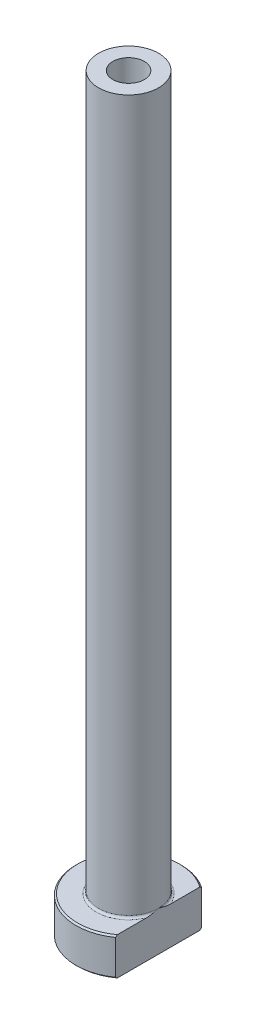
ISO-10303-21;
HEADER;
FILE_DESCRIPTION(('STEP AP214'),'2;1');
FILE_NAME('part.step','',(''),(''),'','','');
FILE_SCHEMA(('AUTOMOTIVE_DESIGN { 1 0 10303 214 1 1 1 1 }'));
ENDSEC;
DATA;
#1=APPLICATION_CONTEXT('core data for automotive mechanical design processes');
#2=APPLICATION_PROTOCOL_DEFINITION('international standard','automotive_design',2000,#1);
#3=PRODUCT_CONTEXT('',#1,'mechanical');
#4=PRODUCT('Part','Part','',(#3));
#5=PRODUCT_RELATED_PRODUCT_CATEGORY('part','',(#4));
#6=PRODUCT_DEFINITION_FORMATION('','',#4);
#7=PRODUCT_DEFINITION_CONTEXT('part definition',#1,'design');
#8=PRODUCT_DEFINITION('design','',#6,#7);
#9=PRODUCT_DEFINITION_SHAPE('','',#8);
#10=(LENGTH_UNIT() NAMED_UNIT(*) SI_UNIT(.MILLI.,.METRE.));
#11=(NAMED_UNIT(*) PLANE_ANGLE_UNIT() SI_UNIT($,.RADIAN.));
#12=(NAMED_UNIT(*) SI_UNIT($,.STERADIAN.) SOLID_ANGLE_UNIT());
#13=UNCERTAINTY_MEASURE_WITH_UNIT(LENGTH_MEASURE(1.E-05),#10,'distance_accuracy_value','');
#14=(GEOMETRIC_REPRESENTATION_CONTEXT(3) GLOBAL_UNCERTAINTY_ASSIGNED_CONTEXT((#13)) GLOBAL_UNIT_ASSIGNED_CONTEXT((#10,
#11,#12)) REPRESENTATION_CONTEXT('',''));
#15=CARTESIAN_POINT('',(0.,0.,0.));
#16=DIRECTION('',(0.,0.,1.));
#17=DIRECTION('',(1.,0.,0.));
#18=AXIS2_PLACEMENT_3D('',#15,#16,#17);
#19=CARTESIAN_POINT('',(0.,92.1876809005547,0.));
#20=DIRECTION('',(0.,1.,0.));
#21=DIRECTION('',(0.,0.,1.));
#22=AXIS2_PLACEMENT_3D('',#19,#20,#21);
#23=CYLINDRICAL_SURFACE('',#22,2.09999999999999);
#24=CARTESIAN_POINT('',(0.,100.,0.));
#25=DIRECTION('',(0.,1.,0.));
#26=DIRECTION('',(0.,0.,1.));
#27=AXIS2_PLACEMENT_3D('',#24,#25,#26);
#28=CIRCLE('',#27,2.09999999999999);
#29=CARTESIAN_POINT('',(0.,100.,2.09999999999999));
#30=VERTEX_POINT('',#29);
#31=EDGE_CURVE('E167',#30,#30,#28,.T.);
#32=ORIENTED_EDGE('',*,*,#31,.T.);
#33=EDGE_LOOP('',(#32));
#34=FACE_BOUND('',#33,.T.);
#35=CARTESIAN_POINT('',(0.,55.,0.));
#36=DIRECTION('',(0.,1.,0.));
#37=DIRECTION('',(0.,0.,1.));
#38=AXIS2_PLACEMENT_3D('',#35,#36,#37);
#39=CIRCLE('',#38,2.09999999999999);
#40=CARTESIAN_POINT('',(0.,55.,2.09999999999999));
#41=VERTEX_POINT('',#40);
#42=EDGE_CURVE('E170',#41,#41,#39,.T.);
#43=ORIENTED_EDGE('',*,*,#42,.F.);
#44=EDGE_LOOP('',(#43));
#45=FACE_BOUND('',#44,.T.);
#46=ADVANCED_FACE('F32',(#34,#45),#23,.F.);
#47=CARTESIAN_POINT('',(-2.09999999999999,100.,0.));
#48=DIRECTION('',(0.,1.,0.));
#49=DIRECTION('',(0.,0.,1.));
#50=AXIS2_PLACEMENT_3D('',#47,#48,#49);
#51=PLANE('',#50);
#52=CARTESIAN_POINT('',(0.,100.,0.));
#53=DIRECTION('',(0.,1.,0.));
#54=DIRECTION('',(0.,0.,1.));
#55=AXIS2_PLACEMENT_3D('',#52,#53,#54);
#56=CIRCLE('',#55,4.);
#57=CARTESIAN_POINT('',(0.,100.,4.));
#58=VERTEX_POINT('',#57);
#59=EDGE_CURVE('E174',#58,#58,#56,.T.);
#60=ORIENTED_EDGE('',*,*,#59,.T.);
#61=EDGE_LOOP('',(#60));
#62=FACE_BOUND('',#61,.T.);
#63=ORIENTED_EDGE('',*,*,#31,.F.);
#64=EDGE_LOOP('',(#63));
#65=FACE_BOUND('',#64,.T.);
#66=ADVANCED_FACE('F157',(#62,#65),#51,.T.);
#67=CARTESIAN_POINT('',(0.,92.1876809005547,0.));
#68=DIRECTION('',(0.,1.,0.));
#69=DIRECTION('',(0.,0.,1.));
#70=AXIS2_PLACEMENT_3D('',#67,#68,#69);
#71=CYLINDRICAL_SURFACE('',#70,3.99999999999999);
#72=CARTESIAN_POINT('',(0.,5.3,0.));
#73=DIRECTION('',(0.,1.,0.));
#74=DIRECTION('',(0.,0.,1.));
#75=AXIS2_PLACEMENT_3D('',#72,#73,#74);
#76=CIRCLE('',#75,3.99999999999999);
#77=CARTESIAN_POINT('',(3.99999999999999,5.3,0.));
#78=VERTEX_POINT('',#77);
#79=EDGE_CURVE('E180',#78,#78,#76,.T.);
#80=ORIENTED_EDGE('',*,*,#79,.T.);
#81=EDGE_LOOP('',(#80));
#82=FACE_BOUND('',#81,.T.);
#83=ORIENTED_EDGE('',*,*,#59,.F.);
#84=EDGE_LOOP('',(#83));
#85=FACE_BOUND('',#84,.T.);
#86=ADVANCED_FACE('F162',(#82,#85),#71,.T.);
#87=CARTESIAN_POINT('',(-3.99999999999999,5.,0.));
#88=DIRECTION('',(0.,1.,0.));
#89=DIRECTION('',(0.,0.,1.));
#90=AXIS2_PLACEMENT_3D('',#87,#88,#89);
#91=PLANE('',#90);
#92=DIRECTION('',(0.,0.,1.));
#93=VECTOR('',#92,1.);
#94=CARTESIAN_POINT('',(4.,5.,0.));
#95=LINE('',#94,#93);
#96=CARTESIAN_POINT('',(4.,5.,-5.499090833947));
#97=VERTEX_POINT('',#96);
#98=CARTESIAN_POINT('',(4.,5.,-1.57797338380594));
#99=VERTEX_POINT('',#98);
#100=EDGE_CURVE('E54',#97,#99,#95,.T.);
#101=ORIENTED_EDGE('',*,*,#100,.F.);
#102=CARTESIAN_POINT('',(0.,5.,0.));
#103=DIRECTION('',(0.,1.,0.));
#104=DIRECTION('',(0.,0.,1.));
#105=AXIS2_PLACEMENT_3D('',#102,#103,#104);
#106=CIRCLE('',#105,6.79999999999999);
#107=CARTESIAN_POINT('',(3.99999999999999,5.,5.499090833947));
#108=VERTEX_POINT('',#107);
#109=EDGE_CURVE('E186',#97,#108,#106,.T.);
#110=ORIENTED_EDGE('',*,*,#109,.T.);
#111=CARTESIAN_POINT('',(4.,5.,1.57797338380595));
#112=VERTEX_POINT('',#111);
#113=EDGE_CURVE('E134',#112,#108,#95,.T.);
#114=ORIENTED_EDGE('',*,*,#113,.F.);
#115=CARTESIAN_POINT('',(0.,5.,0.));
#116=DIRECTION('',(0.,1.,0.));
#117=DIRECTION('',(0.,0.,1.));
#118=AXIS2_PLACEMENT_3D('',#115,#116,#117);
#119=CIRCLE('',#118,4.29999999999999);
#120=EDGE_CURVE('E183',#112,#99,#119,.F.);
#121=ORIENTED_EDGE('',*,*,#120,.T.);
#122=EDGE_LOOP('',(#101,#110,#114,#121));
#123=FACE_BOUND('',#122,.T.);
#124=ADVANCED_FACE('F197',(#123),#91,.T.);
#125=CARTESIAN_POINT('',(0.,92.1876809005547,0.));
#126=DIRECTION('',(0.,1.,0.));
#127=DIRECTION('',(0.,0.,1.));
#128=AXIS2_PLACEMENT_3D('',#125,#126,#127);
#129=CYLINDRICAL_SURFACE('',#128,6.99999999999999);
#130=DIRECTION('',(0.,-1.,0.));
#131=VECTOR('',#130,1.);
#132=CARTESIAN_POINT('',(3.99999999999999,100.,5.74456264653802));
#133=LINE('',#132,#131);
#134=CARTESIAN_POINT('',(3.99999999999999,4.8,5.74456264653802));
#135=VERTEX_POINT('',#134);
#136=CARTESIAN_POINT('',(3.99999999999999,0.199999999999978,5.74456264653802));
#137=VERTEX_POINT('',#136);
#138=EDGE_CURVE('E82',#135,#137,#133,.T.);
#139=ORIENTED_EDGE('',*,*,#138,.F.);
#140=CARTESIAN_POINT('',(0.,4.8,0.));
#141=DIRECTION('',(0.,1.,0.));
#142=DIRECTION('',(0.,0.,1.));
#143=AXIS2_PLACEMENT_3D('',#140,#141,#142);
#144=CIRCLE('',#143,6.99999999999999);
#145=CARTESIAN_POINT('',(4.,4.8,-5.74456264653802));
#146=VERTEX_POINT('',#145);
#147=EDGE_CURVE('E95',#135,#146,#144,.F.);
#148=ORIENTED_EDGE('',*,*,#147,.T.);
#149=DIRECTION('',(0.,-1.,0.));
#150=VECTOR('',#149,1.);
#151=CARTESIAN_POINT('',(4.,100.,-5.74456264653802));
#152=LINE('',#151,#150);
#153=CARTESIAN_POINT('',(4.,0.199999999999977,-5.74456264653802));
#154=VERTEX_POINT('',#153);
#155=EDGE_CURVE('E192',#146,#154,#152,.T.);
#156=ORIENTED_EDGE('',*,*,#155,.T.);
#157=CARTESIAN_POINT('',(0.,0.199999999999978,0.));
#158=DIRECTION('',(0.,-1.,0.));
#159=DIRECTION('',(0.,0.,-1.));
#160=AXIS2_PLACEMENT_3D('',#157,#158,#159);
#161=CIRCLE('',#160,6.99999999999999);
#162=EDGE_CURVE('E98',#154,#137,#161,.F.);
#163=ORIENTED_EDGE('',*,*,#162,.T.);
#164=EDGE_LOOP('',(#139,#148,#156,#163));
#165=FACE_BOUND('',#164,.T.);
#166=ADVANCED_FACE('F190',(#165),#129,.T.);
#167=CARTESIAN_POINT('',(-6.99999999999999,0.,0.));
#168=DIRECTION('',(0.,-1.,0.));
#169=DIRECTION('',(0.,0.,-1.));
#170=AXIS2_PLACEMENT_3D('',#167,#168,#169);
#171=PLANE('',#170);
#172=CARTESIAN_POINT('',(0.,0.,0.));
#173=DIRECTION('',(0.,-1.,0.));
#174=DIRECTION('',(0.,0.,-1.));
#175=AXIS2_PLACEMENT_3D('',#172,#173,#174);
#176=CIRCLE('',#175,2.84999999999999);
#177=CARTESIAN_POINT('',(0.,0.,-2.84999999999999));
#178=VERTEX_POINT('',#177);
#179=EDGE_CURVE('E40',#178,#178,#176,.F.);
#180=ORIENTED_EDGE('',*,*,#179,.T.);
#181=EDGE_LOOP('',(#180));
#182=FACE_BOUND('',#181,.T.);
#183=DIRECTION('',(0.,0.,-1.));
#184=VECTOR('',#183,1.);
#185=CARTESIAN_POINT('',(3.99999999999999,0.,5.74456264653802));
#186=LINE('',#185,#184);
#187=CARTESIAN_POINT('',(3.99999999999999,0.,5.49909083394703));
#188=VERTEX_POINT('',#187);
#189=CARTESIAN_POINT('',(4.,0.,-5.49909083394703));
#190=VERTEX_POINT('',#189);
#191=EDGE_CURVE('E47',#188,#190,#186,.T.);
#192=ORIENTED_EDGE('',*,*,#191,.F.);
#193=CARTESIAN_POINT('',(0.,0.,0.));
#194=DIRECTION('',(0.,-1.,0.));
#195=DIRECTION('',(0.,0.,-1.));
#196=AXIS2_PLACEMENT_3D('',#193,#194,#195);
#197=CIRCLE('',#196,6.80000000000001);
#198=EDGE_CURVE('E92',#188,#190,#197,.T.);
#199=ORIENTED_EDGE('',*,*,#198,.T.);
#200=EDGE_LOOP('',(#192,#199));
#201=FACE_BOUND('',#200,.T.);
#202=ADVANCED_FACE('F91',(#182,#201),#171,.T.);
#203=CARTESIAN_POINT('',(0.,92.1876809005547,0.));
#204=DIRECTION('',(0.,1.,0.));
#205=DIRECTION('',(0.,0.,1.));
#206=AXIS2_PLACEMENT_3D('',#203,#204,#205);
#207=CYLINDRICAL_SURFACE('',#206,2.34999999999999);
#208=CARTESIAN_POINT('',(0.,0.5,0.));
#209=DIRECTION('',(0.,-1.,0.));
#210=DIRECTION('',(0.,0.,-1.));
#211=AXIS2_PLACEMENT_3D('',#208,#209,#210);
#212=CIRCLE('',#211,2.34999999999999);
#213=CARTESIAN_POINT('',(0.,0.5,-2.34999999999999));
#214=VERTEX_POINT('',#213);
#215=EDGE_CURVE('E11',#214,#214,#212,.T.);
#216=ORIENTED_EDGE('',*,*,#215,.T.);
#217=EDGE_LOOP('',(#216));
#218=FACE_BOUND('',#217,.T.);
#219=CARTESIAN_POINT('',(0.,43.,0.));
#220=DIRECTION('',(0.,1.,0.));
#221=DIRECTION('',(0.,0.,1.));
#222=AXIS2_PLACEMENT_3D('',#219,#220,#221);
#223=CIRCLE('',#222,2.35);
#224=CARTESIAN_POINT('',(0.,43.,2.35));
#225=VERTEX_POINT('',#224);
#226=EDGE_CURVE('E172',#225,#225,#223,.T.);
#227=ORIENTED_EDGE('',*,*,#226,.T.);
#228=EDGE_LOOP('',(#227));
#229=FACE_BOUND('',#228,.T.);
#230=ADVANCED_FACE('F215',(#218,#229),#207,.F.);
#231=CARTESIAN_POINT('',(0.,43.,0.));
#232=DIRECTION('',(0.,-1.,0.));
#233=DIRECTION('',(0.,0.,-1.));
#234=AXIS2_PLACEMENT_3D('',#231,#232,#233);
#235=CONICAL_SURFACE('',#234,2.35,0.0208303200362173);
#236=ORIENTED_EDGE('',*,*,#42,.T.);
#237=EDGE_LOOP('',(#236));
#238=FACE_BOUND('',#237,.T.);
#239=ORIENTED_EDGE('',*,*,#226,.F.);
#240=EDGE_LOOP('',(#239));
#241=FACE_BOUND('',#240,.T.);
#242=ADVANCED_FACE('F111',(#238,#241),#235,.F.);
#243=CARTESIAN_POINT('',(0.,5.3,0.));
#244=DIRECTION('',(0.,1.,0.));
#245=DIRECTION('',(0.,0.,1.));
#246=AXIS2_PLACEMENT_3D('',#243,#244,#245);
#247=TOROIDAL_SURFACE('',#246,4.29999999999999,0.3);
#248=ORIENTED_EDGE('',*,*,#120,.F.);
#249=CARTESIAN_POINT('',(3.99999999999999,5.3,0.));
#250=CARTESIAN_POINT('',(3.99999999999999,5.30000062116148,-1.06250765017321E-10));
#251=CARTESIAN_POINT('',(3.99999999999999,5.30000124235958,2.17726005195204E-07));
#252=CARTESIAN_POINT('',(3.99999999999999,5.30000240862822,8.36140864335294E-07));
#253=CARTESIAN_POINT('',(3.99999999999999,5.30000294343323,1.25011664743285E-06));
#254=CARTESIAN_POINT('',(3.99999999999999,5.30000404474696,2.23959314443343E-06));
#255=CARTESIAN_POINT('',(3.99999999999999,5.30000459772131,2.83084434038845E-06));
#256=CARTESIAN_POINT('',(3.99999999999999,5.30000559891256,4.06516571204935E-06));
#257=CARTESIAN_POINT('',(3.99999999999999,5.30000604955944,4.70640052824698E-06));
#258=CARTESIAN_POINT('',(3.99999999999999,5.30000769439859,7.15677155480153E-06));
#259=CARTESIAN_POINT('',(3.99999999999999,5.30000879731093,9.02995907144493E-06));
#260=CARTESIAN_POINT('',(3.99999999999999,5.30001063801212,1.27664879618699E-05));
#261=CARTESIAN_POINT('',(3.99999999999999,5.30001139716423,1.46197799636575E-05));
#262=CARTESIAN_POINT('',(3.99999999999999,5.30001453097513,2.23679210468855E-05));
#263=CARTESIAN_POINT('',(3.99999999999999,5.30001683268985,2.82968733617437E-05));
#264=CARTESIAN_POINT('',(3.99999999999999,5.30002027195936,3.95668711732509E-05));
#265=CARTESIAN_POINT('',(3.99999999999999,5.30002152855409,4.48715445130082E-05));
#266=CARTESIAN_POINT('',(3.99999999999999,5.30003060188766,8.40118173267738E-05));
#267=CARTESIAN_POINT('',(4.,5.30003739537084,0.000118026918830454));
#268=CARTESIAN_POINT('',(4.,5.30006713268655,0.00025221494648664));
#269=CARTESIAN_POINT('',(4.,5.30009559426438,0.000351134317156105));
#270=CARTESIAN_POINT('',(3.99999999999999,5.30020622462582,0.000742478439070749));
#271=CARTESIAN_POINT('',(3.99999999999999,5.30028475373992,0.00103561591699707));
#272=CARTESIAN_POINT('',(4.,5.3005988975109,0.00219920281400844));
#273=CARTESIAN_POINT('',(4.,5.30083905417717,0.00306873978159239));
#274=CARTESIAN_POINT('',(3.99999999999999,5.30183682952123,0.00669141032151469));
#275=CARTESIAN_POINT('',(3.99999999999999,5.30258877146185,0.00944568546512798));
#276=CARTESIAN_POINT('',(4.,5.31066890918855,0.0390293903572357));
#277=CARTESIAN_POINT('',(4.,5.31802631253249,0.0658531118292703));
#278=CARTESIAN_POINT('',(3.99999999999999,5.33239676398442,0.118441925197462));
#279=CARTESIAN_POINT('',(3.99999999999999,5.33941183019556,0.14420651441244));
#280=CARTESIAN_POINT('',(4.,5.35427366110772,0.199017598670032));
#281=CARTESIAN_POINT('',(4.,5.36211313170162,0.228066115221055));
#282=CARTESIAN_POINT('',(4.,5.37776349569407,0.286511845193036));
#283=CARTESIAN_POINT('',(4.,5.3855731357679,0.31590939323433));
#284=CARTESIAN_POINT('',(4.,5.40425662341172,0.386994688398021));
#285=CARTESIAN_POINT('',(4.,5.41505237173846,0.428703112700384));
#286=CARTESIAN_POINT('',(4.,5.43592310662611,0.511098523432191));
#287=CARTESIAN_POINT('',(4.,5.44600969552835,0.551782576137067));
#288=CARTESIAN_POINT('',(4.,5.47850986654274,0.686599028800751));
#289=CARTESIAN_POINT('',(4.,5.49978370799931,0.781011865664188));
#290=CARTESIAN_POINT('',(4.,5.53807543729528,0.97184761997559));
#291=CARTESIAN_POINT('',(4.,5.55504273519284,1.06828120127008));
#292=CARTESIAN_POINT('',(4.,5.57582405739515,1.21752725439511));
#293=CARTESIAN_POINT('',(4.,5.58209796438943,1.26999379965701));
#294=CARTESIAN_POINT('',(4.,5.59210686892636,1.37516324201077));
#295=CARTESIAN_POINT('',(4.,5.59584265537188,1.42786606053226));
#296=CARTESIAN_POINT('',(4.,5.60010438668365,1.53310673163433));
#297=CARTESIAN_POINT('',(4.,5.6006487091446,1.58564378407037));
#298=CARTESIAN_POINT('',(4.,5.59767158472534,1.69058605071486));
#299=CARTESIAN_POINT('',(4.,5.59415502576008,1.74299134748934));
#300=CARTESIAN_POINT('',(4.,5.58503062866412,1.81903290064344));
#301=CARTESIAN_POINT('',(4.,5.58157617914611,1.84292934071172));
#302=CARTESIAN_POINT('',(4.,5.5732995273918,1.89051061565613));
#303=CARTESIAN_POINT('',(4.,5.56847619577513,1.91419525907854));
#304=CARTESIAN_POINT('',(4.,5.55726644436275,1.96092888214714));
#305=CARTESIAN_POINT('',(4.,5.55089740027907,1.98398195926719));
#306=CARTESIAN_POINT('',(4.,5.5362343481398,2.02945550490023));
#307=CARTESIAN_POINT('',(4.,5.52794253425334,2.0518766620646));
#308=CARTESIAN_POINT('',(4.,5.50887098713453,2.09590631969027));
#309=CARTESIAN_POINT('',(4.,5.49806837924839,2.11750508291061));
#310=CARTESIAN_POINT('',(4.,5.47333401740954,2.15885583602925));
#311=CARTESIAN_POINT('',(4.,5.45941272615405,2.17861369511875));
#312=CARTESIAN_POINT('',(4.,5.43588221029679,2.20522942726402));
#313=CARTESIAN_POINT('',(4.,5.42781139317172,2.21344043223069));
#314=CARTESIAN_POINT('',(4.,5.41065114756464,2.2287514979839));
#315=CARTESIAN_POINT('',(4.,5.40156129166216,2.23585108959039));
#316=CARTESIAN_POINT('',(4.,5.38220524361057,2.2485969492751));
#317=CARTESIAN_POINT('',(4.,5.37192420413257,2.25422119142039));
#318=CARTESIAN_POINT('',(4.,5.35045072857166,2.26331064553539));
#319=CARTESIAN_POINT('',(4.,5.33926122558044,2.26678251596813));
#320=CARTESIAN_POINT('',(4.,5.31952044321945,2.27051268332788));
#321=CARTESIAN_POINT('',(4.,5.3110845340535,2.27139016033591));
#322=CARTESIAN_POINT('',(4.,5.29418624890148,2.2716896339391));
#323=CARTESIAN_POINT('',(4.,5.28572387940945,2.27111196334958));
#324=CARTESIAN_POINT('',(4.,5.26904138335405,2.26855580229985));
#325=CARTESIAN_POINT('',(4.,5.26082066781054,2.26658107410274));
#326=CARTESIAN_POINT('',(4.,5.24478214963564,2.26139496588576));
#327=CARTESIAN_POINT('',(4.,5.23696461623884,2.25818277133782));
#328=CARTESIAN_POINT('',(4.,5.21851235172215,2.24908332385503));
#329=CARTESIAN_POINT('',(4.,5.20815219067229,2.24264095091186));
#330=CARTESIAN_POINT('',(4.,5.18857975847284,2.22819957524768));
#331=CARTESIAN_POINT('',(4.,5.17937061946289,2.22019647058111));
#332=CARTESIAN_POINT('',(4.,5.15665383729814,2.19777756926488));
#333=CARTESIAN_POINT('',(4.,5.14403484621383,2.18246908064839));
#334=CARTESIAN_POINT('',(4.,5.12118369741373,2.15020843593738));
#335=CARTESIAN_POINT('',(4.,5.11095480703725,2.13325407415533));
#336=CARTESIAN_POINT('',(4.,5.09273574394,2.09892324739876));
#337=CARTESIAN_POINT('',(4.,5.08468212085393,2.08157988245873));
#338=CARTESIAN_POINT('',(4.,5.07005901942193,2.04627072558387));
#339=CARTESIAN_POINT('',(4.,5.06349101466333,2.02830433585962));
#340=CARTESIAN_POINT('',(4.,5.0455548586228,1.97350761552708));
#341=CARTESIAN_POINT('',(4.,5.03608974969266,1.9360577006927));
#342=CARTESIAN_POINT('',(4.,5.01780569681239,1.84529235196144));
#343=CARTESIAN_POINT('',(4.,5.01077018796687,1.79164082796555));
#344=CARTESIAN_POINT('',(4.,5.00182846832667,1.6837994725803));
#345=CARTESIAN_POINT('',(4.,4.99993887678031,1.62960846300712));
#346=CARTESIAN_POINT('',(4.,5.00006129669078,1.52361204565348));
#347=CARTESIAN_POINT('',(4.,5.00190698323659,1.47180551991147));
#348=CARTESIAN_POINT('',(4.,5.00841243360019,1.36835357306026));
#349=CARTESIAN_POINT('',(4.,5.01307376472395,1.3167082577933));
#350=CARTESIAN_POINT('',(4.,5.02905484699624,1.17431887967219));
#351=CARTESIAN_POINT('',(4.,5.04274090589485,1.08384207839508));
#352=CARTESIAN_POINT('',(4.,5.06701714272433,0.947757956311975));
#353=CARTESIAN_POINT('',(4.,5.07585573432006,0.901814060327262));
#354=CARTESIAN_POINT('',(4.,5.09458665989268,0.810008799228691));
#355=CARTESIAN_POINT('',(4.,5.10448180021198,0.764148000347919));
#356=CARTESIAN_POINT('',(4.,5.12892434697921,0.655631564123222));
#357=CARTESIAN_POINT('',(4.,5.14383556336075,0.593058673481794));
#358=CARTESIAN_POINT('',(4.,5.17458762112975,0.468885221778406));
#359=CARTESIAN_POINT('',(4.,5.19041623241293,0.407281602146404));
#360=CARTESIAN_POINT('',(3.99999999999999,5.22090834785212,0.291232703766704));
#361=CARTESIAN_POINT('',(3.99999999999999,5.23550024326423,0.236768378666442));
#362=CARTESIAN_POINT('',(4.,5.26562550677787,0.125604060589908));
#363=CARTESIAN_POINT('',(4.00000000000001,5.28117250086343,0.0689076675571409));
#364=CARTESIAN_POINT('',(3.99999999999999,5.29741226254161,0.00944154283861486));
#365=CARTESIAN_POINT('',(3.99999999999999,5.29816540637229,0.00668315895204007));
#366=CARTESIAN_POINT('',(4.,5.29916346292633,0.0030595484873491));
#367=CARTESIAN_POINT('',(4.,5.29940273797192,0.00219318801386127));
#368=CARTESIAN_POINT('',(3.99999999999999,5.29971580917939,0.00103357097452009));
#369=CARTESIAN_POINT('',(3.99999999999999,5.29979412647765,0.000741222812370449));
#370=CARTESIAN_POINT('',(4.,5.29990450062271,0.000350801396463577));
#371=CARTESIAN_POINT('',(4.,5.29993292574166,0.000252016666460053));
#372=CARTESIAN_POINT('',(4.,5.29996263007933,0.000117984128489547));
#373=CARTESIAN_POINT('',(3.99999999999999,5.29996941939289,8.39881857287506E-05));
#374=CARTESIAN_POINT('',(3.99999999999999,5.29997848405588,4.48673988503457E-05));
#375=CARTESIAN_POINT('',(3.99999999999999,5.2999797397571,3.95638160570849E-05));
#376=CARTESIAN_POINT('',(3.99999999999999,5.29998317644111,2.82960312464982E-05));
#377=CARTESIAN_POINT('',(3.99999999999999,5.29998547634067,2.23681436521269E-05));
#378=CARTESIAN_POINT('',(3.99999999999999,5.29998860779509,1.46210988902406E-05));
#379=CARTESIAN_POINT('',(3.99999999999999,5.29998936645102,1.27678886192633E-05));
#380=CARTESIAN_POINT('',(3.99999999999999,5.29999120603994,9.031439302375E-06));
#381=CARTESIAN_POINT('',(3.99999999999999,5.29999230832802,7.15823989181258E-06));
#382=CARTESIAN_POINT('',(3.99999999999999,5.29999395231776,4.70775460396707E-06));
#383=CARTESIAN_POINT('',(3.99999999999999,5.29999440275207,4.06646322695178E-06));
#384=CARTESIAN_POINT('',(3.99999999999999,5.2999954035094,2.83199036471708E-06));
#385=CARTESIAN_POINT('',(3.99999999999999,5.29999595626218,2.24064301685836E-06));
#386=CARTESIAN_POINT('',(3.99999999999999,5.29999705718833,1.25093943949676E-06));
#387=CARTESIAN_POINT('',(3.99999999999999,5.29999759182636,8.36840837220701E-07));
#388=CARTESIAN_POINT('',(3.99999999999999,5.29999875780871,2.1811764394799E-07));
#389=CARTESIAN_POINT('',(3.99999999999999,5.29999937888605,1.06243842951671E-10));
#390=CARTESIAN_POINT('',(3.99999999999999,5.3,0.));
#391=B_SPLINE_CURVE_WITH_KNOTS('',3,(#249,#250,#251,#252,#253,#254,#255,#256,#257,#258,#259,
#260,#261,#262,#263,#264,#265,#266,#267,#268,#269,#270,#271,#272,#273,#274,#275,#276,#277,#278,
#279,#280,#281,#282,#283,#284,#285,#286,#287,#288,#289,#290,#291,#292,#293,#294,#295,#296,#297,
#298,#299,#300,#301,#302,#303,#304,#305,#306,#307,#308,#309,#310,#311,#312,#313,#314,#315,#316,
#317,#318,#319,#320,#321,#322,#323,#324,#325,#326,#327,#328,#329,#330,#331,#332,#333,#334,#335,
#336,#337,#338,#339,#340,#341,#342,#343,#344,#345,#346,#347,#348,#349,#350,#351,#352,#353,#354,
#355,#356,#357,#358,#359,#360,#361,#362,#363,#364,#365,#366,#367,#368,#369,#370,#371,#372,#373,
#374,#375,#376,#377,#378,#379,#380,#381,#382,#383,#384,#385,#386,#387,#388,#389,#390),
.UNSPECIFIED.,.T.,.F.,(4,2,2,2,2,2,2,2,2,2,2,2,2,2,2,2,2,2,2,2,2,2,2,2,2,2,2,2,2,2,2,2,2,2,2,2,
2,2,2,2,2,2,2,2,2,2,2,2,2,2,2,2,2,2,2,2,2,2,2,2,2,2,2,2,2,2,2,2,2,2,4),(0.,1.87484546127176E-06,
3.9018026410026E-06,6.31684155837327E-06,8.66652381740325E-06,1.51627602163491E-05,
2.11657993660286E-05,4.02090834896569E-05,5.65429548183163E-05,0.000160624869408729,
0.000469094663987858,0.00137985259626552,0.00408571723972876,0.012651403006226,
0.0960918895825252,0.176200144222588,0.266463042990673,0.357714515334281,0.486961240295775,
0.612707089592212,0.902988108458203,1.19653589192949,1.35501075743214,1.51343634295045,
1.67094875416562,1.82827177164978,1.9006759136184,1.97313996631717,2.04482437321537,
2.11642737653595,2.18871023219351,2.26075412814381,2.29521947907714,2.32969934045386,
2.36466792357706,2.39952778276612,2.4248542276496,2.45017488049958,2.47542760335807,
2.5006969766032,2.53708899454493,2.57357798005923,2.6327603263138,2.69202310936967,
2.74930315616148,2.80663977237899,2.92223125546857,3.08420752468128,3.24670629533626,
3.40212850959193,3.55763731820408,3.8319296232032,3.97228382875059,4.11302057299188,
4.30598130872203,4.49678885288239,4.66594443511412,4.84230602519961,4.85088453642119,
4.85358051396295,4.85448881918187,4.85479687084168,4.8549008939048,4.85491722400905,
4.85493626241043,4.85494226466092,4.85494875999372,4.8549511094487,4.85495352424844,
4.85495555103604,4.85495742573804),.UNSPECIFIED.);
#392=EDGE_CURVE('E126',#112,#78,#391,.T.);
#393=ORIENTED_EDGE('',*,*,#392,.T.);
#394=ORIENTED_EDGE('',*,*,#79,.F.);
#395=CARTESIAN_POINT('',(3.99999999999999,5.3,0.));
#396=CARTESIAN_POINT('',(3.99999999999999,5.29999937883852,1.06252046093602E-10));
#397=CARTESIAN_POINT('',(3.99999999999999,5.29999875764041,-2.17726003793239E-07));
#398=CARTESIAN_POINT('',(3.99999999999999,5.29999759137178,-8.36140862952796E-07));
#399=CARTESIAN_POINT('',(3.99999999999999,5.29999705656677,-1.25011664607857E-06));
#400=CARTESIAN_POINT('',(3.99999999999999,5.29999595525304,-2.23959314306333E-06));
#401=CARTESIAN_POINT('',(3.99999999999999,5.29999540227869,-2.83084433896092E-06));
#402=CARTESIAN_POINT('',(3.99999999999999,5.29999440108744,-4.06516571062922E-06));
#403=CARTESIAN_POINT('',(3.99999999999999,5.29999395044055,-4.70640052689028E-06));
#404=CARTESIAN_POINT('',(3.99999999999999,5.2999923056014,-7.15677155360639E-06));
#405=CARTESIAN_POINT('',(3.99999999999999,5.29999120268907,-9.02995907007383E-06));
#406=CARTESIAN_POINT('',(3.99999999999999,5.29998936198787,-1.27664879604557E-05));
#407=CARTESIAN_POINT('',(3.99999999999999,5.29998860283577,-1.46197799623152E-05));
#408=CARTESIAN_POINT('',(3.99999999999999,5.29998546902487,-2.23679210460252E-05));
#409=CARTESIAN_POINT('',(3.99999999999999,5.29998316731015,-2.82968733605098E-05));
#410=CARTESIAN_POINT('',(3.99999999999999,5.29997972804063,-3.95668711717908E-05));
#411=CARTESIAN_POINT('',(3.99999999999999,5.2999784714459,-4.48715445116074E-05));
#412=CARTESIAN_POINT('',(3.99999999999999,5.29996939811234,-8.40118173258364E-05));
#413=CARTESIAN_POINT('',(4.,5.29996260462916,-0.000118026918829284));
#414=CARTESIAN_POINT('',(4.,5.29993286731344,-0.000252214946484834));
#415=CARTESIAN_POINT('',(4.,5.29990440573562,-0.000351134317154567));
#416=CARTESIAN_POINT('',(3.99999999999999,5.29979377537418,-0.000742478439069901));
#417=CARTESIAN_POINT('',(3.99999999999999,5.29971524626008,-0.00103561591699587));
#418=CARTESIAN_POINT('',(4.,5.2994011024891,-0.0021992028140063));
#419=CARTESIAN_POINT('',(4.,5.29916094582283,-0.00306873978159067));
#420=CARTESIAN_POINT('',(3.99999999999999,5.29816317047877,-0.00669141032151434));
#421=CARTESIAN_POINT('',(3.99999999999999,5.29741122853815,-0.00944568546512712));
#422=CARTESIAN_POINT('',(4.,5.28933109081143,-0.03902939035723));
#423=CARTESIAN_POINT('',(4.,5.2819736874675,-0.0658531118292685));
#424=CARTESIAN_POINT('',(3.99999999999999,5.26760323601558,-0.118441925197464));
#425=CARTESIAN_POINT('',(3.99999999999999,5.26058816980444,-0.144206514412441));
#426=CARTESIAN_POINT('',(4.,5.24572633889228,-0.199017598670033));
#427=CARTESIAN_POINT('',(4.,5.23788686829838,-0.228066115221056));
#428=CARTESIAN_POINT('',(4.,5.22223650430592,-0.286511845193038));
#429=CARTESIAN_POINT('',(4.,5.21442686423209,-0.31590939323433));
#430=CARTESIAN_POINT('',(4.,5.19574337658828,-0.386994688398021));
#431=CARTESIAN_POINT('',(4.,5.18494762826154,-0.428703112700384));
#432=CARTESIAN_POINT('',(4.,5.16407689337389,-0.51109852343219));
#433=CARTESIAN_POINT('',(4.,5.15399030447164,-0.551782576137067));
#434=CARTESIAN_POINT('',(4.,5.12149013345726,-0.68659902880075));
#435=CARTESIAN_POINT('',(4.,5.10021629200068,-0.781011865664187));
#436=CARTESIAN_POINT('',(4.,5.06192456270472,-0.971847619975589));
#437=CARTESIAN_POINT('',(4.,5.04495726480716,-1.06828120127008));
#438=CARTESIAN_POINT('',(4.,5.02417594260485,-1.2175272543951));
#439=CARTESIAN_POINT('',(4.,5.01790203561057,-1.269993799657));
#440=CARTESIAN_POINT('',(4.,5.00789313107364,-1.37516324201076));
#441=CARTESIAN_POINT('',(4.,5.00415734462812,-1.42786606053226));
#442=CARTESIAN_POINT('',(4.,4.99989561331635,-1.53310673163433));
#443=CARTESIAN_POINT('',(4.,4.9993512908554,-1.58564378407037));
#444=CARTESIAN_POINT('',(4.,5.00232841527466,-1.69058605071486));
#445=CARTESIAN_POINT('',(4.,5.00584497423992,-1.74299134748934));
#446=CARTESIAN_POINT('',(4.,5.01496937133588,-1.81903290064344));
#447=CARTESIAN_POINT('',(4.,5.01842382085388,-1.84292934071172));
#448=CARTESIAN_POINT('',(4.,5.0267004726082,-1.89051061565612));
#449=CARTESIAN_POINT('',(4.,5.03152380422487,-1.91419525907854));
#450=CARTESIAN_POINT('',(4.,5.04273355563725,-1.96092888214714));
#451=CARTESIAN_POINT('',(4.,5.04910259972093,-1.98398195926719));
#452=CARTESIAN_POINT('',(4.,5.0637656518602,-2.02945550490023));
#453=CARTESIAN_POINT('',(4.,5.07205746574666,-2.0518766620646));
#454=CARTESIAN_POINT('',(4.,5.09112901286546,-2.09590631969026));
#455=CARTESIAN_POINT('',(4.,5.10193162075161,-2.11750508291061));
#456=CARTESIAN_POINT('',(4.,5.12666598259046,-2.15885583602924));
#457=CARTESIAN_POINT('',(4.,5.14058727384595,-2.17861369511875));
#458=CARTESIAN_POINT('',(4.,5.16411778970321,-2.20522942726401));
#459=CARTESIAN_POINT('',(4.,5.17218860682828,-2.21344043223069));
#460=CARTESIAN_POINT('',(4.,5.18934885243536,-2.22875149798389));
#461=CARTESIAN_POINT('',(4.,5.19843870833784,-2.23585108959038));
#462=CARTESIAN_POINT('',(4.,5.21779475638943,-2.2485969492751));
#463=CARTESIAN_POINT('',(4.,5.22807579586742,-2.25422119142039));
#464=CARTESIAN_POINT('',(4.,5.24954927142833,-2.26331064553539));
#465=CARTESIAN_POINT('',(4.,5.26073877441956,-2.26678251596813));
#466=CARTESIAN_POINT('',(4.,5.28047955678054,-2.27051268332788));
#467=CARTESIAN_POINT('',(4.,5.28891546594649,-2.27139016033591));
#468=CARTESIAN_POINT('',(4.,5.30581375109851,-2.2716896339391));
#469=CARTESIAN_POINT('',(4.,5.31427612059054,-2.27111196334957));
#470=CARTESIAN_POINT('',(4.,5.33095861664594,-2.26855580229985));
#471=CARTESIAN_POINT('',(4.,5.33917933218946,-2.26658107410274));
#472=CARTESIAN_POINT('',(4.,5.35521785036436,-2.26139496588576));
#473=CARTESIAN_POINT('',(4.,5.36303538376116,-2.25818277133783));
#474=CARTESIAN_POINT('',(4.,5.38148764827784,-2.24908332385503));
#475=CARTESIAN_POINT('',(4.,5.39184780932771,-2.24264095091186));
#476=CARTESIAN_POINT('',(4.,5.41142024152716,-2.22819957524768));
#477=CARTESIAN_POINT('',(4.,5.42062938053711,-2.22019647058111));
#478=CARTESIAN_POINT('',(4.,5.44334616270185,-2.19777756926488));
#479=CARTESIAN_POINT('',(4.,5.45596515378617,-2.1824690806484));
#480=CARTESIAN_POINT('',(4.,5.47881630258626,-2.15020843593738));
#481=CARTESIAN_POINT('',(4.,5.48904519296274,-2.13325407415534));
#482=CARTESIAN_POINT('',(4.,5.50726425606,-2.09892324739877));
#483=CARTESIAN_POINT('',(4.,5.51531787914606,-2.08157988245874));
#484=CARTESIAN_POINT('',(4.,5.52994098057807,-2.04627072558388));
#485=CARTESIAN_POINT('',(4.,5.53650898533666,-2.02830433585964));
#486=CARTESIAN_POINT('',(4.,5.55444514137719,-1.9735076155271));
#487=CARTESIAN_POINT('',(4.,5.56391025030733,-1.93605770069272));
#488=CARTESIAN_POINT('',(4.,5.58219430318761,-1.84529235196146));
#489=CARTESIAN_POINT('',(4.,5.58922981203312,-1.79164082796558));
#490=CARTESIAN_POINT('',(4.,5.59817153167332,-1.68379947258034));
#491=CARTESIAN_POINT('',(4.,5.60006112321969,-1.62960846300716));
#492=CARTESIAN_POINT('',(4.,5.59993870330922,-1.52361204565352));
#493=CARTESIAN_POINT('',(4.,5.59809301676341,-1.47180551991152));
#494=CARTESIAN_POINT('',(4.,5.59158756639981,-1.36835357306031));
#495=CARTESIAN_POINT('',(4.,5.58692623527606,-1.31670825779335));
#496=CARTESIAN_POINT('',(4.,5.57094515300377,-1.17431887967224));
#497=CARTESIAN_POINT('',(4.,5.55725909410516,-1.08384207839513));
#498=CARTESIAN_POINT('',(4.,5.53298285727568,-0.947757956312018));
#499=CARTESIAN_POINT('',(4.,5.52414426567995,-0.901814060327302));
#500=CARTESIAN_POINT('',(4.,5.50541334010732,-0.810008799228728));
#501=CARTESIAN_POINT('',(4.,5.49551819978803,-0.764148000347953));
#502=CARTESIAN_POINT('',(4.,5.4710756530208,-0.655631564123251));
#503=CARTESIAN_POINT('',(4.,5.45616443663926,-0.59305867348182));
#504=CARTESIAN_POINT('',(4.,5.42541237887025,-0.468885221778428));
#505=CARTESIAN_POINT('',(4.,5.40958376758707,-0.407281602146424));
#506=CARTESIAN_POINT('',(3.99999999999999,5.37909165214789,-0.291232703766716));
#507=CARTESIAN_POINT('',(3.99999999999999,5.36449975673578,-0.236768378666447));
#508=CARTESIAN_POINT('',(4.,5.33437449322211,-0.125604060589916));
#509=CARTESIAN_POINT('',(4.00000000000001,5.31882749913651,-0.0689076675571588));
#510=CARTESIAN_POINT('',(3.99999999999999,5.30258773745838,-0.00944154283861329));
#511=CARTESIAN_POINT('',(3.99999999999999,5.30183459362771,-0.00668315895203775));
#512=CARTESIAN_POINT('',(4.,5.30083653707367,-0.00305954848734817));
#513=CARTESIAN_POINT('',(4.,5.30059726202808,-0.00219318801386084));
#514=CARTESIAN_POINT('',(3.99999999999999,5.30028419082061,-0.00103357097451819));
#515=CARTESIAN_POINT('',(3.99999999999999,5.30020587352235,-0.000741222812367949));
#516=CARTESIAN_POINT('',(4.,5.30009549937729,-0.000350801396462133));
#517=CARTESIAN_POINT('',(4.,5.30006707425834,-0.000252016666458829));
#518=CARTESIAN_POINT('',(4.,5.30003736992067,-0.000117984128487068));
#519=CARTESIAN_POINT('',(3.99999999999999,5.30003058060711,-8.39881857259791E-05));
#520=CARTESIAN_POINT('',(3.99999999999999,5.30002151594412,-4.4867398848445E-05));
#521=CARTESIAN_POINT('',(3.99999999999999,5.3000202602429,-3.9563816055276E-05));
#522=CARTESIAN_POINT('',(3.99999999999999,5.30001682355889,-2.82960312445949E-05));
#523=CARTESIAN_POINT('',(3.99999999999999,5.30001452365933,-2.23681436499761E-05));
#524=CARTESIAN_POINT('',(3.99999999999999,5.30001139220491,-1.46210988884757E-05));
#525=CARTESIAN_POINT('',(3.99999999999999,5.30001063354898,-1.2767888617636E-05));
#526=CARTESIAN_POINT('',(3.99999999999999,5.30000879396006,-9.03143930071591E-06));
#527=CARTESIAN_POINT('',(3.99999999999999,5.30000769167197,-7.15823989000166E-06));
#528=CARTESIAN_POINT('',(3.99999999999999,5.30000604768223,-4.70775460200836E-06));
#529=CARTESIAN_POINT('',(3.99999999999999,5.30000559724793,-4.06646322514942E-06));
#530=CARTESIAN_POINT('',(3.99999999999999,5.30000459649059,-2.83199036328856E-06));
#531=CARTESIAN_POINT('',(3.99999999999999,5.30000404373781,-2.24064301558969E-06));
#532=CARTESIAN_POINT('',(3.99999999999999,5.30000294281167,-1.25093943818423E-06));
#533=CARTESIAN_POINT('',(3.99999999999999,5.30000240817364,-8.36840835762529E-07));
#534=CARTESIAN_POINT('',(3.99999999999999,5.30000124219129,-2.18117642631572E-07));
#535=CARTESIAN_POINT('',(3.99999999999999,5.30000062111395,-1.06242708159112E-10));
#536=CARTESIAN_POINT('',(3.99999999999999,5.3,0.));
#537=B_SPLINE_CURVE_WITH_KNOTS('',3,(#395,#396,#397,#398,#399,#400,#401,#402,#403,#404,#405,
#406,#407,#408,#409,#410,#411,#412,#413,#414,#415,#416,#417,#418,#419,#420,#421,#422,#423,#424,
#425,#426,#427,#428,#429,#430,#431,#432,#433,#434,#435,#436,#437,#438,#439,#440,#441,#442,#443,
#444,#445,#446,#447,#448,#449,#450,#451,#452,#453,#454,#455,#456,#457,#458,#459,#460,#461,#462,
#463,#464,#465,#466,#467,#468,#469,#470,#471,#472,#473,#474,#475,#476,#477,#478,#479,#480,#481,
#482,#483,#484,#485,#486,#487,#488,#489,#490,#491,#492,#493,#494,#495,#496,#497,#498,#499,#500,
#501,#502,#503,#504,#505,#506,#507,#508,#509,#510,#511,#512,#513,#514,#515,#516,#517,#518,#519,
#520,#521,#522,#523,#524,#525,#526,#527,#528,#529,#530,#531,#532,#533,#534,#535,#536),
.UNSPECIFIED.,.T.,.F.,(4,2,2,2,2,2,2,2,2,2,2,2,2,2,2,2,2,2,2,2,2,2,2,2,2,2,2,2,2,2,2,2,2,2,2,2,
2,2,2,2,2,2,2,2,2,2,2,2,2,2,2,2,2,2,2,2,2,2,2,2,2,2,2,2,2,2,2,2,2,2,4),(0.,1.87484546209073E-06,
3.90180264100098E-06,6.31684155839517E-06,8.6665238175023E-06,1.5162760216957E-05,
2.11657993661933E-05,4.02090834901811E-05,5.65429548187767E-05,0.00016062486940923,
0.000469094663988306,0.00137985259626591,0.00408571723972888,0.0126514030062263,
0.0960918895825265,0.176200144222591,0.266463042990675,0.357714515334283,0.486961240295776,
0.612707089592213,0.902988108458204,1.19653589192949,1.35501075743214,1.51343634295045,
1.67094875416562,1.82827177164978,1.9006759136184,1.97313996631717,2.04482437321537,
2.11642737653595,2.18871023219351,2.2607541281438,2.29521947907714,2.32969934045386,
2.36466792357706,2.39952778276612,2.4248542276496,2.45017488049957,2.47542760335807,
2.50069697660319,2.53708899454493,2.57357798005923,2.63276032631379,2.69202310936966,
2.74930315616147,2.80663977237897,2.92223125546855,3.08420752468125,3.24670629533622,
3.40212850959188,3.55763731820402,3.83192962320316,3.97228382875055,4.11302057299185,
4.305981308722,4.49678885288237,4.66594443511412,4.84230602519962,4.85088453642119,
4.85358051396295,4.85448881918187,4.85479687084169,4.8549008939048,4.85491722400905,
4.85493626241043,4.85494226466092,4.85494875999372,4.8549511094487,4.85495352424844,
4.85495555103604,4.85495742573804),.UNSPECIFIED.);
#538=EDGE_CURVE('E135',#78,#99,#537,.T.);
#539=ORIENTED_EDGE('',*,*,#538,.T.);
#540=EDGE_LOOP('',(#248,#393,#394,#539));
#541=FACE_BOUND('',#540,.T.);
#542=ADVANCED_FACE('F141',(#541),#247,.F.);
#543=CARTESIAN_POINT('',(0.,5.,0.));
#544=DIRECTION('',(0.,-1.,0.));
#545=DIRECTION('',(0.,0.,-1.));
#546=AXIS2_PLACEMENT_3D('',#543,#544,#545);
#547=CONICAL_SURFACE('',#546,6.79999999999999,0.785398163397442);
#548=CARTESIAN_POINT('',(4.,-1.45712845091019,-12.6392822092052));
#549=CARTESIAN_POINT('',(4.,-1.24364466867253,-12.4153556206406));
#550=CARTESIAN_POINT('',(4.,-1.03042430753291,-12.1911774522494));
#551=CARTESIAN_POINT('',(4.,-0.604617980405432,-11.7422167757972));
#552=CARTESIAN_POINT('',(4.,-0.392032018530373,-11.5174342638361));
#553=CARTESIAN_POINT('',(4.,0.0324624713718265,-11.0670952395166));
#554=CARTESIAN_POINT('',(4.,0.244370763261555,-10.8415385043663));
#555=CARTESIAN_POINT('',(4.,0.667290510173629,-10.3895875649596));
#556=CARTESIAN_POINT('',(4.,0.878301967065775,-10.1631933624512));
#557=CARTESIAN_POINT('',(4.,1.51385375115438,-9.47810122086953));
#558=CARTESIAN_POINT('',(4.,1.93676291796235,-9.017882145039));
#559=CARTESIAN_POINT('',(4.,2.56612335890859,-8.32309905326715));
#560=CARTESIAN_POINT('',(4.,2.77505666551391,-8.09078457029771));
#561=CARTESIAN_POINT('',(4.,3.19080254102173,-7.62426940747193));
#562=CARTESIAN_POINT('',(4.,3.39761512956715,-7.39006874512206));
#563=CARTESIAN_POINT('',(4.,3.87870763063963,-6.83891844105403));
#564=CARTESIAN_POINT('',(4.,4.15190978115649,-6.52102188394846));
#565=CARTESIAN_POINT('',(4.,4.55642425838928,-6.0396090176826));
#566=CARTESIAN_POINT('',(4.,4.69041050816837,-5.87833992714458));
#567=CARTESIAN_POINT('',(4.,4.95616531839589,-5.55398469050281));
#568=CARTESIAN_POINT('',(4.,5.08793391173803,-5.39089857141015));
#569=CARTESIAN_POINT('',(4.,5.34841712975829,-5.06288801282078));
#570=CARTESIAN_POINT('',(4.,5.47713786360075,-4.89796843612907));
#571=CARTESIAN_POINT('',(4.,5.73107494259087,-4.56545535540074));
#572=CARTESIAN_POINT('',(4.,5.85629144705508,-4.39786197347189));
#573=CARTESIAN_POINT('',(4.,6.10211465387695,-4.05948444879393));
#574=CARTESIAN_POINT('',(4.,6.22272435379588,-3.88870249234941));
#575=CARTESIAN_POINT('',(4.,6.45796076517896,-3.54308312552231));
#576=CARTESIAN_POINT('',(4.,6.57258867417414,-3.3682465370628));
#577=CARTESIAN_POINT('',(4.,6.76866603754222,-3.05381396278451));
#578=CARTESIAN_POINT('',(4.,6.85173773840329,-2.91523359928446));
#579=CARTESIAN_POINT('',(4.,7.0117453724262,-2.63451965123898));
#580=CARTESIAN_POINT('',(4.,7.08868042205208,-2.49238555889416));
#581=CARTESIAN_POINT('',(4.,7.2345943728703,-2.20416961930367));
#582=CARTESIAN_POINT('',(4.,7.30357836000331,-2.05809037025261));
#583=CARTESIAN_POINT('',(4.,7.43135520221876,-1.76151732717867));
#584=CARTESIAN_POINT('',(4.,7.4901511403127,-1.6110248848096));
#585=CARTESIAN_POINT('',(4.,7.58249315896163,-1.34142099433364));
#586=CARTESIAN_POINT('',(4.,7.61872660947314,-1.22323501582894));
#587=CARTESIAN_POINT('',(4.,7.68223354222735,-0.984492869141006));
#588=CARTESIAN_POINT('',(4.,7.70951040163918,-0.863937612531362));
#589=CARTESIAN_POINT('',(4.,7.75377914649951,-0.621342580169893));
#590=CARTESIAN_POINT('',(4.,7.77080509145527,-0.499309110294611));
#591=CARTESIAN_POINT('',(4.,7.7937877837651,-0.254194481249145));
#592=CARTESIAN_POINT('',(4.,7.79974523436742,-0.131113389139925));
#593=CARTESIAN_POINT('',(4.,7.80023957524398,0.115517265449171));
#594=CARTESIAN_POINT('',(4.,7.7947351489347,0.23906691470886));
#595=CARTESIAN_POINT('',(4.,7.77255119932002,0.485148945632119));
#596=CARTESIAN_POINT('',(4.,7.75587091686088,0.607681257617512));
#597=CARTESIAN_POINT('',(4.,7.71218353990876,0.851269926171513));
#598=CARTESIAN_POINT('',(4.,7.68514362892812,0.972320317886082));
#599=CARTESIAN_POINT('',(4.,7.6220120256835,1.21200276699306));
#600=CARTESIAN_POINT('',(4.,7.58591962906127,1.33063463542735));
#601=CARTESIAN_POINT('',(4.,7.45980070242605,1.70122439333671));
#602=CARTESIAN_POINT('',(4.,7.35572950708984,1.94843335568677));
#603=CARTESIAN_POINT('',(4.,7.18186715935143,2.31048534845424));
#604=CARTESIAN_POINT('',(4.,7.12087684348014,2.42983561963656));
#605=CARTESIAN_POINT('',(4.,6.99403531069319,2.66593629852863));
#606=CARTESIAN_POINT('',(3.99999999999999,6.92818466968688,2.78268701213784));
#607=CARTESIAN_POINT('',(3.99999999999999,6.79157875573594,3.01550895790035));
#608=CARTESIAN_POINT('',(3.99999999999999,6.72076681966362,3.13154660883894));
#609=CARTESIAN_POINT('',(3.99999999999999,6.57583116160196,3.36153379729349));
#610=CARTESIAN_POINT('',(3.99999999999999,6.50170736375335,3.47548328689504));
#611=CARTESIAN_POINT('',(3.99999999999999,6.35080982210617,3.70145107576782));
#612=CARTESIAN_POINT('',(3.99999999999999,6.27403866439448,3.81347110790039));
#613=CARTESIAN_POINT('',(3.99999999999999,6.11824120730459,4.03592316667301));
#614=CARTESIAN_POINT('',(3.99999999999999,6.03921496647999,4.14635523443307));
#615=CARTESIAN_POINT('',(3.99999999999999,5.81506547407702,4.45397159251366));
#616=CARTESIAN_POINT('',(3.99999999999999,5.66782256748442,4.64961120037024));
#617=CARTESIAN_POINT('',(3.99999999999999,5.36880597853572,5.03740600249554));
#618=CARTESIAN_POINT('',(3.99999999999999,5.2170318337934,5.22956083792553));
#619=CARTESIAN_POINT('',(3.99999999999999,4.90999105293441,5.61115465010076));
#620=CARTESIAN_POINT('',(3.99999999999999,4.75472331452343,5.80059273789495));
#621=CARTESIAN_POINT('',(3.99999999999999,4.44150758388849,6.17724364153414));
#622=CARTESIAN_POINT('',(3.99999999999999,4.28355951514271,6.36445639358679));
#623=CARTESIAN_POINT('',(3.99999999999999,3.96525805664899,6.73740614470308));
#624=CARTESIAN_POINT('',(3.99999999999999,3.80490084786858,6.92313987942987));
#625=CARTESIAN_POINT('',(3.99999999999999,3.48247055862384,7.29311320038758));
#626=CARTESIAN_POINT('',(3.99999999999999,3.32039746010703,7.47735277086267));
#627=CARTESIAN_POINT('',(3.99999999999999,2.83216188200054,8.02814826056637));
#628=CARTESIAN_POINT('',(3.99999999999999,2.50391696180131,8.39285790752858));
#629=CARTESIAN_POINT('',(3.99999999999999,1.87512078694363,9.08414492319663));
#630=CARTESIAN_POINT('',(3.99999999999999,1.57491666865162,9.41103929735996));
#631=CARTESIAN_POINT('',(3.99999999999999,0.972153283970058,10.0626830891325));
#632=CARTESIAN_POINT('',(3.99999999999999,0.669593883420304,10.3874323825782));
#633=CARTESIAN_POINT('',(3.99999999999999,0.0637759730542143,11.0341169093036));
#634=CARTESIAN_POINT('',(3.99999999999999,-0.239476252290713,11.3560580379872));
#635=CARTESIAN_POINT('',(3.99999999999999,-0.847356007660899,11.9985921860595));
#636=CARTESIAN_POINT('',(3.99999999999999,-1.15198342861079,12.3191853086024));
#637=CARTESIAN_POINT('',(3.99999999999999,-1.45712845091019,12.6392822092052));
#638=B_SPLINE_CURVE_WITH_KNOTS('',3,(#548,#549,#550,#551,#552,#553,#554,#555,#556,#557,#558,
#559,#560,#561,#562,#563,#564,#565,#566,#567,#568,#569,#570,#571,#572,#573,#574,#575,#576,#577,
#578,#579,#580,#581,#582,#583,#584,#585,#586,#587,#588,#589,#590,#591,#592,#593,#594,#595,#596,
#597,#598,#599,#600,#601,#602,#603,#604,#605,#606,#607,#608,#609,#610,#611,#612,#613,#614,#615,
#616,#617,#618,#619,#620,#621,#622,#623,#624,#625,#626,#627,#628,#629,#630,#631,#632,#633,#634,
#635,#636,#637),.UNSPECIFIED.,.F.,.F.,(4,2,2,2,2,2,2,2,2,2,2,2,2,2,2,2,2,2,2,2,2,2,2,2,2,2,2,2,
2,2,2,2,2,2,2,2,2,2,2,2,2,2,2,2,4),(0.,0.928152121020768,1.85631024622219,2.78476262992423,
3.71321307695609,5.58823033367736,6.52556078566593,7.46288254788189,8.72028576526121,
9.34927045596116,9.97824580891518,10.6058302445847,11.2333861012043,11.860526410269,
12.4875406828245,12.9721363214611,13.4568016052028,13.9411551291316,14.4253618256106,
14.7959147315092,15.1663277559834,15.535503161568,15.9046551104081,16.2751400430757,
16.645650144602,17.017343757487,17.3890663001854,18.1913996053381,18.5934522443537,
18.9954573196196,19.4032100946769,19.8109722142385,20.2183467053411,20.6257106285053,
21.3601838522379,22.0947322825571,22.8295158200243,23.5643203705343,24.3004480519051,
25.0365834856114,26.5085499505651,27.8400191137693,29.1715646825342,30.4983881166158,
31.825108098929),.UNSPECIFIED.);
#639=EDGE_CURVE('E133',#146,#97,#638,.T.);
#640=ORIENTED_EDGE('',*,*,#639,.F.);
#641=ORIENTED_EDGE('',*,*,#147,.F.);
#642=EDGE_CURVE('E118',#108,#135,#638,.T.);
#643=ORIENTED_EDGE('',*,*,#642,.F.);
#644=ORIENTED_EDGE('',*,*,#109,.F.);
#645=EDGE_LOOP('',(#640,#641,#643,#644));
#646=FACE_BOUND('',#645,.T.);
#647=ADVANCED_FACE('F145',(#646),#547,.T.);
#648=CARTESIAN_POINT('',(0.,0.199999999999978,0.));
#649=DIRECTION('',(0.,1.,0.));
#650=DIRECTION('',(0.,0.,1.));
#651=AXIS2_PLACEMENT_3D('',#648,#649,#650);
#652=CONICAL_SURFACE('',#651,6.99999999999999,0.785398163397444);
#653=CARTESIAN_POINT('',(3.99999999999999,6.45712845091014,12.6392822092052));
#654=CARTESIAN_POINT('',(3.99999999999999,6.24364466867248,12.4153556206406));
#655=CARTESIAN_POINT('',(3.99999999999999,6.03042430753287,12.1911774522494));
#656=CARTESIAN_POINT('',(3.99999999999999,5.60461798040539,11.7422167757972));
#657=CARTESIAN_POINT('',(3.99999999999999,5.39203201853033,11.5174342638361));
#658=CARTESIAN_POINT('',(3.99999999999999,4.96753752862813,11.0670952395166));
#659=CARTESIAN_POINT('',(3.99999999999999,4.7556292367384,10.8415385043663));
#660=CARTESIAN_POINT('',(3.99999999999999,4.33270948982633,10.3895875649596));
#661=CARTESIAN_POINT('',(3.99999999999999,4.12169803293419,10.1631933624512));
#662=CARTESIAN_POINT('',(3.99999999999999,3.48614624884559,9.47810122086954));
#663=CARTESIAN_POINT('',(3.99999999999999,3.06323708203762,9.01788214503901));
#664=CARTESIAN_POINT('',(3.99999999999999,2.43387664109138,8.32309905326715));
#665=CARTESIAN_POINT('',(3.99999999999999,2.22494333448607,8.09078457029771));
#666=CARTESIAN_POINT('',(3.99999999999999,1.80919745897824,7.62426940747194));
#667=CARTESIAN_POINT('',(3.99999999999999,1.60238487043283,7.39006874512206));
#668=CARTESIAN_POINT('',(3.99999999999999,1.12129236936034,6.83891844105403));
#669=CARTESIAN_POINT('',(3.99999999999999,0.848090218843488,6.52102188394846));
#670=CARTESIAN_POINT('',(3.99999999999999,0.443575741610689,6.0396090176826));
#671=CARTESIAN_POINT('',(3.99999999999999,0.309589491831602,5.87833992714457));
#672=CARTESIAN_POINT('',(3.99999999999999,0.0438346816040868,5.5539846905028));
#673=CARTESIAN_POINT('',(3.99999999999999,-0.0879339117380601,5.39089857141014));
#674=CARTESIAN_POINT('',(3.99999999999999,-0.348417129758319,5.06288801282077));
#675=CARTESIAN_POINT('',(3.99999999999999,-0.477137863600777,4.89796843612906));
#676=CARTESIAN_POINT('',(3.99999999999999,-0.731074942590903,4.56545535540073));
#677=CARTESIAN_POINT('',(3.99999999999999,-0.856291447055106,4.39786197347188));
#678=CARTESIAN_POINT('',(3.99999999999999,-1.10211465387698,4.05948444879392));
#679=CARTESIAN_POINT('',(3.99999999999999,-1.22272435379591,3.8887024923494));
#680=CARTESIAN_POINT('',(3.99999999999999,-1.45796076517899,3.54308312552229));
#681=CARTESIAN_POINT('',(3.99999999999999,-1.57258867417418,3.36824653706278));
#682=CARTESIAN_POINT('',(3.99999999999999,-1.76866603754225,3.05381396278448));
#683=CARTESIAN_POINT('',(4.,-1.85173773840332,2.91523359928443));
#684=CARTESIAN_POINT('',(4.,-2.01174537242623,2.63451965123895));
#685=CARTESIAN_POINT('',(4.,-2.08868042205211,2.49238555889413));
#686=CARTESIAN_POINT('',(4.,-2.23459437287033,2.20416961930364));
#687=CARTESIAN_POINT('',(4.,-2.30357836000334,2.05809037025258));
#688=CARTESIAN_POINT('',(4.,-2.43135520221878,1.76151732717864));
#689=CARTESIAN_POINT('',(4.,-2.49015114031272,1.61102488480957));
#690=CARTESIAN_POINT('',(4.,-2.58249315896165,1.34142099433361));
#691=CARTESIAN_POINT('',(4.,-2.61872660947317,1.22323501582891));
#692=CARTESIAN_POINT('',(4.,-2.68223354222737,0.984492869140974));
#693=CARTESIAN_POINT('',(4.,-2.7095104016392,0.863937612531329));
#694=CARTESIAN_POINT('',(4.,-2.75377914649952,0.621342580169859));
#695=CARTESIAN_POINT('',(4.,-2.77080509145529,0.499309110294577));
#696=CARTESIAN_POINT('',(4.,-2.79378778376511,0.254194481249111));
#697=CARTESIAN_POINT('',(4.,-2.79974523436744,0.131113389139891));
#698=CARTESIAN_POINT('',(4.,-2.80023957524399,-0.115517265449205));
#699=CARTESIAN_POINT('',(4.,-2.79473514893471,-0.239066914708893));
#700=CARTESIAN_POINT('',(4.,-2.77255119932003,-0.485148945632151));
#701=CARTESIAN_POINT('',(4.,-2.75587091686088,-0.607681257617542));
#702=CARTESIAN_POINT('',(4.,-2.71218353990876,-0.851269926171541));
#703=CARTESIAN_POINT('',(4.,-2.68514362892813,-0.972320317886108));
#704=CARTESIAN_POINT('',(4.,-2.6220120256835,-1.21200276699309));
#705=CARTESIAN_POINT('',(4.,-2.58591962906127,-1.33063463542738));
#706=CARTESIAN_POINT('',(4.,-2.45980070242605,-1.70122439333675));
#707=CARTESIAN_POINT('',(4.,-2.35572950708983,-1.94843335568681));
#708=CARTESIAN_POINT('',(4.,-2.18186715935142,-2.31048534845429));
#709=CARTESIAN_POINT('',(4.,-2.12087684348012,-2.42983561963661));
#710=CARTESIAN_POINT('',(4.,-1.99403531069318,-2.66593629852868));
#711=CARTESIAN_POINT('',(4.,-1.92818466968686,-2.7826870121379));
#712=CARTESIAN_POINT('',(4.,-1.79157875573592,-3.01550895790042));
#713=CARTESIAN_POINT('',(4.,-1.72076681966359,-3.13154660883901));
#714=CARTESIAN_POINT('',(4.,-1.57583116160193,-3.36153379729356));
#715=CARTESIAN_POINT('',(4.,-1.50170736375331,-3.47548328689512));
#716=CARTESIAN_POINT('',(4.,-1.35080982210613,-3.7014510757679));
#717=CARTESIAN_POINT('',(4.,-1.27403866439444,-3.81347110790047));
#718=CARTESIAN_POINT('',(4.,-1.11824120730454,-4.0359231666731));
#719=CARTESIAN_POINT('',(4.,-1.03921496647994,-4.14635523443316));
#720=CARTESIAN_POINT('',(4.,-0.815065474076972,-4.45397159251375));
#721=CARTESIAN_POINT('',(4.,-0.667822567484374,-4.64961120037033));
#722=CARTESIAN_POINT('',(4.,-0.368805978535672,-5.03740600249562));
#723=CARTESIAN_POINT('',(4.,-0.217031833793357,-5.22956083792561));
#724=CARTESIAN_POINT('',(4.,0.0900089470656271,-5.61115465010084));
#725=CARTESIAN_POINT('',(4.,0.245276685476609,-5.80059273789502));
#726=CARTESIAN_POINT('',(4.,0.558492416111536,-6.17724364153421));
#727=CARTESIAN_POINT('',(4.,0.716440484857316,-6.36445639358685));
#728=CARTESIAN_POINT('',(4.,1.03474194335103,-6.73740614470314));
#729=CARTESIAN_POINT('',(4.,1.19509915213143,-6.92313987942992));
#730=CARTESIAN_POINT('',(4.,1.51752944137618,-7.29311320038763));
#731=CARTESIAN_POINT('',(4.,1.67960253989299,-7.47735277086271));
#732=CARTESIAN_POINT('',(4.,2.16783811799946,-8.0281482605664));
#733=CARTESIAN_POINT('',(4.,2.49608303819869,-8.39285790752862));
#734=CARTESIAN_POINT('',(4.,3.12487921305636,-9.08414492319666));
#735=CARTESIAN_POINT('',(4.,3.42508333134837,-9.41103929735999));
#736=CARTESIAN_POINT('',(4.,4.02784671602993,-10.0626830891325));
#737=CARTESIAN_POINT('',(4.,4.33040611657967,-10.3874323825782));
#738=CARTESIAN_POINT('',(4.,4.93622402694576,-11.0341169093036));
#739=CARTESIAN_POINT('',(4.,5.23947625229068,-11.3560580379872));
#740=CARTESIAN_POINT('',(4.,5.84735600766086,-11.9985921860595));
#741=CARTESIAN_POINT('',(4.,6.15198342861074,-12.3191853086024));
#742=CARTESIAN_POINT('',(4.,6.45712845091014,-12.6392822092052));
#743=B_SPLINE_CURVE_WITH_KNOTS('',3,(#653,#654,#655,#656,#657,#658,#659,#660,#661,#662,#663,
#664,#665,#666,#667,#668,#669,#670,#671,#672,#673,#674,#675,#676,#677,#678,#679,#680,#681,#682,
#683,#684,#685,#686,#687,#688,#689,#690,#691,#692,#693,#694,#695,#696,#697,#698,#699,#700,#701,
#702,#703,#704,#705,#706,#707,#708,#709,#710,#711,#712,#713,#714,#715,#716,#717,#718,#719,#720,
#721,#722,#723,#724,#725,#726,#727,#728,#729,#730,#731,#732,#733,#734,#735,#736,#737,#738,#739,
#740,#741,#742),.UNSPECIFIED.,.F.,.F.,(4,2,2,2,2,2,2,2,2,2,2,2,2,2,2,2,2,2,2,2,2,2,2,2,2,2,2,2,
2,2,2,2,2,2,2,2,2,2,2,2,2,2,2,2,4),(0.,0.928152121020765,1.85631024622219,2.78476262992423,
3.71321307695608,5.58823033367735,6.52556078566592,7.46288254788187,8.7202857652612,
9.34927045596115,9.97824580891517,10.6058302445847,11.2333861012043,11.860526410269,
12.4875406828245,12.9721363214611,13.4568016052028,13.9411551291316,14.4253618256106,
14.7959147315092,15.1663277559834,15.535503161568,15.9046551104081,16.2751400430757,
16.645650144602,17.017343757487,17.3890663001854,18.1913996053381,18.5934522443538,
18.9954573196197,19.4032100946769,19.8109722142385,20.2183467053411,20.6257106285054,
21.360183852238,22.0947322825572,22.8295158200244,23.5643203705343,24.3004480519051,
25.0365834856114,26.5085499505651,27.8400191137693,29.1715646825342,30.4983881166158,
31.825108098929),.UNSPECIFIED.);
#744=EDGE_CURVE('E79',#137,#188,#743,.T.);
#745=ORIENTED_EDGE('',*,*,#744,.F.);
#746=ORIENTED_EDGE('',*,*,#162,.F.);
#747=EDGE_CURVE('E87',#190,#154,#743,.T.);
#748=ORIENTED_EDGE('',*,*,#747,.F.);
#749=ORIENTED_EDGE('',*,*,#198,.F.);
#750=EDGE_LOOP('',(#745,#746,#748,#749));
#751=FACE_BOUND('',#750,.T.);
#752=ADVANCED_FACE('F94',(#751),#652,.T.);
#753=CARTESIAN_POINT('',(3.99999999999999,100.,5.74456264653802));
#754=DIRECTION('',(-1.,0.,0.));
#755=DIRECTION('',(0.,0.,1.));
#756=AXIS2_PLACEMENT_3D('',#753,#754,#755);
#757=PLANE('',#756);
#758=ORIENTED_EDGE('',*,*,#392,.F.);
#759=ORIENTED_EDGE('',*,*,#113,.T.);
#760=ORIENTED_EDGE('',*,*,#642,.T.);
#761=ORIENTED_EDGE('',*,*,#138,.T.);
#762=ORIENTED_EDGE('',*,*,#744,.T.);
#763=ORIENTED_EDGE('',*,*,#191,.T.);
#764=ORIENTED_EDGE('',*,*,#747,.T.);
#765=ORIENTED_EDGE('',*,*,#155,.F.);
#766=ORIENTED_EDGE('',*,*,#639,.T.);
#767=ORIENTED_EDGE('',*,*,#100,.T.);
#768=ORIENTED_EDGE('',*,*,#538,.F.);
#769=EDGE_LOOP('',(#758,#759,#760,#761,#762,#763,#764,#765,#766,#767,#768));
#770=FACE_BOUND('',#769,.T.);
#771=ADVANCED_FACE('F80',(#770),#757,.F.);
#772=CARTESIAN_POINT('',(0.,0.,0.));
#773=DIRECTION('',(0.,-1.,0.));
#774=DIRECTION('',(0.,0.,-1.));
#775=AXIS2_PLACEMENT_3D('',#772,#773,#774);
#776=CONICAL_SURFACE('',#775,2.84999999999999,0.785398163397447);
#777=ORIENTED_EDGE('',*,*,#215,.F.);
#778=EDGE_LOOP('',(#777));
#779=FACE_BOUND('',#778,.T.);
#780=ORIENTED_EDGE('',*,*,#179,.F.);
#781=EDGE_LOOP('',(#780));
#782=FACE_BOUND('',#781,.T.);
#783=ADVANCED_FACE('F34',(#779,#782),#776,.F.);
#784=CLOSED_SHELL('',(#46,#66,#86,#124,#166,#202,#230,#242,#542,#647,#752,#771,#783));
#785=MANIFOLD_SOLID_BREP('B2',#784);
#786=ADVANCED_BREP_SHAPE_REPRESENTATION('',(#18,#785),#14);
#787=SHAPE_DEFINITION_REPRESENTATION(#9,#786);
ENDSEC;
END-ISO-10303-21;
